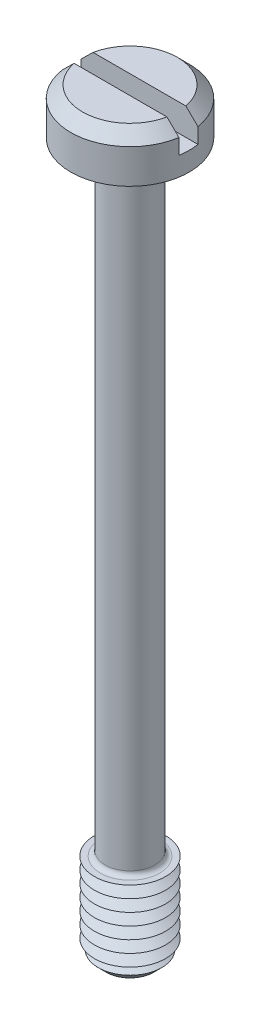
ISO-10303-21;
HEADER;
FILE_DESCRIPTION(('STEP AP214'),'2;1');
FILE_NAME('part.step','',(''),(''),'','','');
FILE_SCHEMA(('AUTOMOTIVE_DESIGN { 1 0 10303 214 1 1 1 1 }'));
ENDSEC;
DATA;
#1=APPLICATION_CONTEXT('core data for automotive mechanical design processes');
#2=APPLICATION_PROTOCOL_DEFINITION('international standard','automotive_design',2000,#1);
#3=PRODUCT_CONTEXT('',#1,'mechanical');
#4=PRODUCT('Part','Part','',(#3));
#5=PRODUCT_RELATED_PRODUCT_CATEGORY('part','',(#4));
#6=PRODUCT_DEFINITION_FORMATION('','',#4);
#7=PRODUCT_DEFINITION_CONTEXT('part definition',#1,'design');
#8=PRODUCT_DEFINITION('design','',#6,#7);
#9=PRODUCT_DEFINITION_SHAPE('','',#8);
#10=(LENGTH_UNIT() NAMED_UNIT(*) SI_UNIT(.MILLI.,.METRE.));
#11=(NAMED_UNIT(*) PLANE_ANGLE_UNIT() SI_UNIT($,.RADIAN.));
#12=(NAMED_UNIT(*) SI_UNIT($,.STERADIAN.) SOLID_ANGLE_UNIT());
#13=UNCERTAINTY_MEASURE_WITH_UNIT(LENGTH_MEASURE(1.E-05),#10,'distance_accuracy_value','');
#14=(GEOMETRIC_REPRESENTATION_CONTEXT(3) GLOBAL_UNCERTAINTY_ASSIGNED_CONTEXT((#13)) GLOBAL_UNIT_ASSIGNED_CONTEXT((#10,
#11,#12)) REPRESENTATION_CONTEXT('',''));
#15=CARTESIAN_POINT('',(0.,0.,0.));
#16=DIRECTION('',(0.,0.,1.));
#17=DIRECTION('',(1.,0.,0.));
#18=AXIS2_PLACEMENT_3D('',#15,#16,#17);
#19=CARTESIAN_POINT('',(0.,3.9,0.));
#20=DIRECTION('',(0.,1.,0.));
#21=DIRECTION('',(0.,0.,1.));
#22=AXIS2_PLACEMENT_3D('',#19,#20,#21);
#23=PLANE('',#22);
#24=DIRECTION('',(-1.,0.,0.));
#25=VECTOR('',#24,1.);
#26=CARTESIAN_POINT('',(5.,3.9,-0.8));
#27=LINE('',#26,#25);
#28=CARTESIAN_POINT('',(3.91918358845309,3.9,-0.8));
#29=VERTEX_POINT('',#28);
#30=CARTESIAN_POINT('',(-3.91918358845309,3.9,-0.8));
#31=VERTEX_POINT('',#30);
#32=EDGE_CURVE('E110',#29,#31,#27,.T.);
#33=ORIENTED_EDGE('',*,*,#32,.F.);
#34=CARTESIAN_POINT('',(0.,3.9,0.));
#35=DIRECTION('',(0.,1.,0.));
#36=DIRECTION('',(0.,0.,1.));
#37=AXIS2_PLACEMENT_3D('',#34,#35,#36);
#38=CIRCLE('',#37,4.);
#39=EDGE_CURVE('E113',#29,#31,#38,.T.);
#40=ORIENTED_EDGE('',*,*,#39,.T.);
#41=EDGE_LOOP('',(#33,#40));
#42=FACE_BOUND('',#41,.T.);
#43=ADVANCED_FACE('F39',(#42),#23,.T.);
#44=CARTESIAN_POINT('',(0.,3.9,0.));
#45=DIRECTION('',(0.,-1.,0.));
#46=DIRECTION('',(0.,0.,-1.));
#47=AXIS2_PLACEMENT_3D('',#44,#45,#46);
#48=CONICAL_SURFACE('',#47,4.,0.785398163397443);
#49=CARTESIAN_POINT('',(11.0010756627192,-3.13012537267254,-0.8));
#50=CARTESIAN_POINT('',(10.6180645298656,-2.74813121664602,-0.8));
#51=CARTESIAN_POINT('',(10.2350087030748,-2.36618183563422,-0.8));
#52=CARTESIAN_POINT('',(9.46873746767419,-1.60241986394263,-0.8));
#53=CARTESIAN_POINT('',(9.08552205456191,-1.22060727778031,-0.8));
#54=CARTESIAN_POINT('',(8.31861292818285,-0.456918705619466,-0.8));
#55=CARTESIAN_POINT('',(7.93491906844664,-0.0750428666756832,-0.8));
#56=CARTESIAN_POINT('',(7.16722555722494,0.68837857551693,-0.8));
#57=CARTESIAN_POINT('',(6.78322591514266,1.06992418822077,-0.8));
#58=CARTESIAN_POINT('',(6.01856215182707,1.82868912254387,-0.8));
#59=CARTESIAN_POINT('',(5.63790309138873,2.20591354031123,-0.8));
#60=CARTESIAN_POINT('',(5.06622054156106,2.7710831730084,-0.8));
#61=CARTESIAN_POINT('',(4.87553531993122,2.9593704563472,-0.8));
#62=CARTESIAN_POINT('',(4.49384424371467,3.33561647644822,-0.8));
#63=CARTESIAN_POINT('',(4.30283839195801,3.52357521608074,-0.8));
#64=CARTESIAN_POINT('',(3.92044271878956,3.89893397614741,-0.8));
#65=CARTESIAN_POINT('',(3.72905310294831,4.08633420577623,-0.8));
#66=CARTESIAN_POINT('',(3.34554223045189,4.46039762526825,-0.8));
#67=CARTESIAN_POINT('',(3.15342094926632,4.64706078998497,-0.8));
#68=CARTESIAN_POINT('',(2.76802565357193,5.01913697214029,-0.8));
#69=CARTESIAN_POINT('',(2.5747518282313,5.20455018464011,-0.8));
#70=CARTESIAN_POINT('',(2.28318236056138,5.4809110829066,-0.8));
#71=CARTESIAN_POINT('',(2.18571873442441,5.57273577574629,-0.8));
#72=CARTESIAN_POINT('',(1.9899843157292,5.75552004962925,-0.8));
#73=CARTESIAN_POINT('',(1.89171354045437,5.84647964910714,-0.8));
#74=CARTESIAN_POINT('',(1.76578543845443,5.96147491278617,-0.8));
#75=CARTESIAN_POINT('',(1.73869031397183,5.98612635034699,-0.8));
#76=CARTESIAN_POINT('',(1.68439529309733,6.03531372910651,-0.8));
#77=CARTESIAN_POINT('',(1.65719539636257,6.05984966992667,-0.8));
#78=CARTESIAN_POINT('',(1.57541627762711,6.13326356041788,-0.8));
#79=CARTESIAN_POINT('',(1.52066027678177,6.18194515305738,-0.8));
#80=CARTESIAN_POINT('',(1.41038257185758,6.27874171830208,-0.8));
#81=CARTESIAN_POINT('',(1.35485918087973,6.32685477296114,-0.8));
#82=CARTESIAN_POINT('',(1.24299231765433,6.42210730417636,-0.8));
#83=CARTESIAN_POINT('',(1.18664895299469,6.46924690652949,-0.8));
#84=CARTESIAN_POINT('',(1.07845249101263,6.55754663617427,-0.8));
#85=CARTESIAN_POINT('',(1.02670624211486,6.5988371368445,-0.8));
#86=CARTESIAN_POINT('',(0.921961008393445,6.67979338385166,-0.8));
#87=CARTESIAN_POINT('',(0.868962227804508,6.71945939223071,-0.8));
#88=CARTESIAN_POINT('',(0.761295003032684,6.79630361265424,-0.8));
#89=CARTESIAN_POINT('',(0.706629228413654,6.8334855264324,-0.8));
#90=CARTESIAN_POINT('',(0.594896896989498,6.90399895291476,-0.8));
#91=CARTESIAN_POINT('',(0.537833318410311,6.93733506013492,-0.8));
#92=CARTESIAN_POINT('',(0.428390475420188,6.9935634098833,-0.8));
#93=CARTESIAN_POINT('',(0.376435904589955,7.01726022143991,-0.8));
#94=CARTESIAN_POINT('',(0.269759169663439,7.05717670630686,-0.8));
#95=CARTESIAN_POINT('',(0.215046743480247,7.07342088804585,-0.8));
#96=CARTESIAN_POINT('',(0.113016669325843,7.09332110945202,-0.8));
#97=CARTESIAN_POINT('',(0.0660435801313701,7.098660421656,-0.8));
#98=CARTESIAN_POINT('',(-0.0280587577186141,7.10088875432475,-0.8));
#99=CARTESIAN_POINT('',(-0.0751877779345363,7.09778705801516,-0.8));
#100=CARTESIAN_POINT('',(-0.180723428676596,7.08192474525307,-0.8));
#101=CARTESIAN_POINT('',(-0.238762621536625,7.06679554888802,-0.8));
#102=CARTESIAN_POINT('',(-0.323499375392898,7.0374840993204,-0.8));
#103=CARTESIAN_POINT('',(-0.351441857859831,7.02656594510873,-0.8));
#104=CARTESIAN_POINT('',(-0.406569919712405,7.0029590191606,-0.8));
#105=CARTESIAN_POINT('',(-0.433755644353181,6.99027059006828,-0.8));
#106=CARTESIAN_POINT('',(-0.504673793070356,6.95489235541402,-0.8));
#107=CARTESIAN_POINT('',(-0.547808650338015,6.93101671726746,-0.8));
#108=CARTESIAN_POINT('',(-0.632566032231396,6.8806964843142,-0.8));
#109=CARTESIAN_POINT('',(-0.674187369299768,6.8542499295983,-0.8));
#110=CARTESIAN_POINT('',(-0.756326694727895,6.79950439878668,-0.8));
#111=CARTESIAN_POINT('',(-0.796841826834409,6.77120117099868,-0.8));
#112=CARTESIAN_POINT('',(-0.876938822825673,6.7132985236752,-0.8));
#113=CARTESIAN_POINT('',(-0.916520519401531,6.68369887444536,-0.8));
#114=CARTESIAN_POINT('',(-1.03465904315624,6.59312324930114,-0.8));
#115=CARTESIAN_POINT('',(-1.1121133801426,6.53071425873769,-0.8));
#116=CARTESIAN_POINT('',(-1.26505454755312,6.40381418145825,-0.8));
#117=CARTESIAN_POINT('',(-1.34054439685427,6.33932667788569,-0.8));
#118=CARTESIAN_POINT('',(-1.48913173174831,6.20997083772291,-0.8));
#119=CARTESIAN_POINT('',(-1.56224816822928,6.14512422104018,-0.8));
#120=CARTESIAN_POINT('',(-1.70765393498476,6.01451044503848,-0.8));
#121=CARTESIAN_POINT('',(-1.7799432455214,5.9487432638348,-0.8));
#122=CARTESIAN_POINT('',(-1.99594639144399,5.75046596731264,-0.8));
#123=CARTESIAN_POINT('',(-2.13877767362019,5.6169958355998,-0.8));
#124=CARTESIAN_POINT('',(-2.42324632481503,5.34853800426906,-0.8));
#125=CARTESIAN_POINT('',(-2.56488247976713,5.21354902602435,-0.8));
#126=CARTESIAN_POINT('',(-2.84730929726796,4.94270932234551,-0.8));
#127=CARTESIAN_POINT('',(-2.98810001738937,4.80685865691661,-0.8));
#128=CARTESIAN_POINT('',(-3.26818763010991,4.5354997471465,-0.8));
#129=CARTESIAN_POINT('',(-3.4074882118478,4.39999530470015,-0.8));
#130=CARTESIAN_POINT('',(-3.68570899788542,4.12859172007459,-0.8));
#131=CARTESIAN_POINT('',(-3.82462919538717,3.99269257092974,-0.8));
#132=CARTESIAN_POINT('',(-4.2408754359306,3.58468153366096,-0.8));
#133=CARTESIAN_POINT('',(-4.51779300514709,3.31215310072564,-0.8));
#134=CARTESIAN_POINT('',(-5.05279381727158,2.78443938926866,-0.8));
#135=CARTESIAN_POINT('',(-5.3109163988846,2.52929393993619,-0.8));
#136=CARTESIAN_POINT('',(-5.82680751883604,2.01864429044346,-0.8));
#137=CARTESIAN_POINT('',(-6.08457605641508,1.76314008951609,-0.8));
#138=CARTESIAN_POINT('',(-6.8576050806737,0.996194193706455,-0.8));
#139=CARTESIAN_POINT('',(-7.37251152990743,0.484395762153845,-0.8));
#140=CARTESIAN_POINT('',(-8.40657233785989,-0.544392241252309,-0.8));
#141=CARTESIAN_POINT('',(-8.92572224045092,-1.06138628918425,-0.8));
#142=CARTESIAN_POINT('',(-9.9636287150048,-2.09560660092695,-0.8));
#143=CARTESIAN_POINT('',(-10.4823853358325,-2.61283281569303,-0.8));
#144=CARTESIAN_POINT('',(-11.0010756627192,-3.13012537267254,-0.8));
#145=B_SPLINE_CURVE_WITH_KNOTS('',3,(#49,#50,#51,#52,#53,#54,#55,#56,#57,#58,#59,#60,#61,#62,
#63,#64,#65,#66,#67,#68,#69,#70,#71,#72,#73,#74,#75,#76,#77,#78,#79,#80,#81,#82,#83,#84,#85,#86,
#87,#88,#89,#90,#91,#92,#93,#94,#95,#96,#97,#98,#99,#100,#101,#102,#103,#104,#105,#106,#107,
#108,#109,#110,#111,#112,#113,#114,#115,#116,#117,#118,#119,#120,#121,#122,#123,#124,#125,#126,
#127,#128,#129,#130,#131,#132,#133,#134,#135,#136,#137,#138,#139,#140,#141,#142,#143,#144),
.UNSPECIFIED.,.F.,.F.,(4,2,2,2,2,2,2,2,2,2,2,2,2,2,2,2,2,2,2,2,2,2,2,2,2,2,2,2,2,2,2,2,2,2,2,2,
2,2,2,2,2,2,2,2,2,2,2,4),(0.,1.62282275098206,3.24569489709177,4.86971791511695,
6.49369278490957,8.10142191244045,8.90535980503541,9.70929063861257,10.5128682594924,
11.3164730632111,12.1199494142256,12.5216659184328,12.9233738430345,13.0332669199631,
13.1431603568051,13.3629580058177,13.5833578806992,13.8037290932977,14.0023112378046,
14.2008612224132,14.3991084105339,14.5971162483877,14.7680800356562,14.9384774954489,
15.0795987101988,15.2205647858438,15.399358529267,15.4893211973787,15.579266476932,
15.7270328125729,15.8749126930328,16.0231439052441,16.1714014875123,16.4697244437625,
16.7675580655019,17.0607348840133,17.3539186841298,17.9403574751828,18.527333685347,
19.1142694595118,19.6972736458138,20.2802881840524,21.4458742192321,22.5346981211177,
23.6235243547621,25.8015035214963,27.9995014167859,30.1971550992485),.UNSPECIFIED.);
#146=CARTESIAN_POINT('',(4.93558507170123,2.89999999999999,-0.8));
#147=VERTEX_POINT('',#146);
#148=EDGE_CURVE('E252',#147,#29,#145,.T.);
#149=ORIENTED_EDGE('',*,*,#148,.F.);
#150=CARTESIAN_POINT('',(0.,2.89999999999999,0.));
#151=DIRECTION('',(0.,1.,0.));
#152=DIRECTION('',(0.,0.,1.));
#153=AXIS2_PLACEMENT_3D('',#150,#151,#152);
#154=CIRCLE('',#153,5.);
#155=CARTESIAN_POINT('',(-4.93558507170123,2.89999999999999,-0.8));
#156=VERTEX_POINT('',#155);
#157=EDGE_CURVE('E128',#156,#147,#154,.F.);
#158=ORIENTED_EDGE('',*,*,#157,.F.);
#159=EDGE_CURVE('E102',#31,#156,#145,.T.);
#160=ORIENTED_EDGE('',*,*,#159,.F.);
#161=ORIENTED_EDGE('',*,*,#39,.F.);
#162=EDGE_LOOP('',(#149,#158,#160,#161));
#163=FACE_BOUND('',#162,.T.);
#164=ADVANCED_FACE('F214',(#163),#48,.T.);
#165=CARTESIAN_POINT('',(0.,-60.,0.));
#166=DIRECTION('',(0.,1.,0.));
#167=DIRECTION('',(0.,0.,1.));
#168=AXIS2_PLACEMENT_3D('',#165,#166,#167);
#169=CYLINDRICAL_SURFACE('',#168,2.1);
#170=CARTESIAN_POINT('',(0.,-52.1,0.));
#171=DIRECTION('',(0.,-1.,0.));
#172=DIRECTION('',(0.,0.,-1.));
#173=AXIS2_PLACEMENT_3D('',#170,#171,#172);
#174=CIRCLE('',#173,2.1);
#175=CARTESIAN_POINT('',(0.,-52.1,-2.1));
#176=VERTEX_POINT('',#175);
#177=EDGE_CURVE('E123',#176,#176,#174,.F.);
#178=ORIENTED_EDGE('',*,*,#177,.T.);
#179=EDGE_LOOP('',(#178));
#180=FACE_BOUND('',#179,.T.);
#181=CARTESIAN_POINT('',(0.,-0.399999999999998,0.));
#182=DIRECTION('',(0.,1.,0.));
#183=DIRECTION('',(0.,0.,1.));
#184=AXIS2_PLACEMENT_3D('',#181,#182,#183);
#185=CIRCLE('',#184,2.1);
#186=CARTESIAN_POINT('',(0.,-0.399999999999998,2.1));
#187=VERTEX_POINT('',#186);
#188=EDGE_CURVE('E349',#187,#187,#185,.F.);
#189=ORIENTED_EDGE('',*,*,#188,.T.);
#190=EDGE_LOOP('',(#189));
#191=FACE_BOUND('',#190,.T.);
#192=ADVANCED_FACE('F210',(#180,#191),#169,.T.);
#193=CARTESIAN_POINT('',(0.,3.9,0.));
#194=DIRECTION('',(0.,-1.,0.));
#195=DIRECTION('',(0.,0.,-1.));
#196=AXIS2_PLACEMENT_3D('',#193,#194,#195);
#197=CYLINDRICAL_SURFACE('',#196,5.);
#198=ORIENTED_EDGE('',*,*,#157,.T.);
#199=DIRECTION('',(0.,-1.,0.));
#200=VECTOR('',#199,1.);
#201=CARTESIAN_POINT('',(4.93558507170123,3.9,-0.8));
#202=LINE('',#201,#200);
#203=CARTESIAN_POINT('',(4.93558507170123,1.6,-0.8));
#204=VERTEX_POINT('',#203);
#205=EDGE_CURVE('E64',#147,#204,#202,.T.);
#206=ORIENTED_EDGE('',*,*,#205,.T.);
#207=CARTESIAN_POINT('',(0.,1.6,0.));
#208=DIRECTION('',(0.,1.,0.));
#209=DIRECTION('',(0.,0.,1.));
#210=AXIS2_PLACEMENT_3D('',#207,#208,#209);
#211=CIRCLE('',#210,5.);
#212=CARTESIAN_POINT('',(4.93558507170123,1.6,0.8));
#213=VERTEX_POINT('',#212);
#214=EDGE_CURVE('E11',#213,#204,#211,.T.);
#215=ORIENTED_EDGE('',*,*,#214,.F.);
#216=DIRECTION('',(0.,-1.,0.));
#217=VECTOR('',#216,1.);
#218=CARTESIAN_POINT('',(4.93558507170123,3.9,0.8));
#219=LINE('',#218,#217);
#220=CARTESIAN_POINT('',(4.93558507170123,2.89999999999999,0.8));
#221=VERTEX_POINT('',#220);
#222=EDGE_CURVE('E269',#213,#221,#219,.F.);
#223=ORIENTED_EDGE('',*,*,#222,.T.);
#224=CARTESIAN_POINT('',(-4.93558507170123,2.89999999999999,0.8));
#225=VERTEX_POINT('',#224);
#226=EDGE_CURVE('E120',#221,#225,#154,.F.);
#227=ORIENTED_EDGE('',*,*,#226,.T.);
#228=DIRECTION('',(0.,-1.,0.));
#229=VECTOR('',#228,1.);
#230=CARTESIAN_POINT('',(-4.93558507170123,3.9,0.8));
#231=LINE('',#230,#229);
#232=CARTESIAN_POINT('',(-4.93558507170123,1.6,0.8));
#233=VERTEX_POINT('',#232);
#234=EDGE_CURVE('E96',#225,#233,#231,.T.);
#235=ORIENTED_EDGE('',*,*,#234,.T.);
#236=CARTESIAN_POINT('',(-4.93558507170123,1.6,-0.8));
#237=VERTEX_POINT('',#236);
#238=EDGE_CURVE('E44',#237,#233,#211,.T.);
#239=ORIENTED_EDGE('',*,*,#238,.F.);
#240=DIRECTION('',(0.,-1.,0.));
#241=VECTOR('',#240,1.);
#242=CARTESIAN_POINT('',(-4.93558507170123,3.9,-0.8));
#243=LINE('',#242,#241);
#244=EDGE_CURVE('E274',#237,#156,#243,.F.);
#245=ORIENTED_EDGE('',*,*,#244,.T.);
#246=EDGE_LOOP('',(#198,#206,#215,#223,#227,#235,#239,#245));
#247=FACE_BOUND('',#246,.T.);
#248=CARTESIAN_POINT('',(0.,0.,0.));
#249=DIRECTION('',(0.,1.,0.));
#250=DIRECTION('',(0.,0.,1.));
#251=AXIS2_PLACEMENT_3D('',#248,#249,#250);
#252=CIRCLE('',#251,5.);
#253=CARTESIAN_POINT('',(0.,0.,5.));
#254=VERTEX_POINT('',#253);
#255=EDGE_CURVE('E334',#254,#254,#252,.T.);
#256=ORIENTED_EDGE('',*,*,#255,.T.);
#257=EDGE_LOOP('',(#256));
#258=FACE_BOUND('',#257,.T.);
#259=ADVANCED_FACE('F213',(#247,#258),#197,.T.);
#260=DIRECTION('',(1.,0.,0.));
#261=VECTOR('',#260,1.);
#262=CARTESIAN_POINT('',(5.,3.9,0.8));
#263=LINE('',#262,#261);
#264=CARTESIAN_POINT('',(-3.91918358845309,3.9,0.8));
#265=VERTEX_POINT('',#264);
#266=CARTESIAN_POINT('',(3.91918358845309,3.9,0.8));
#267=VERTEX_POINT('',#266);
#268=EDGE_CURVE('E56',#265,#267,#263,.T.);
#269=ORIENTED_EDGE('',*,*,#268,.F.);
#270=EDGE_CURVE('E108',#265,#267,#38,.T.);
#271=ORIENTED_EDGE('',*,*,#270,.T.);
#272=EDGE_LOOP('',(#269,#271));
#273=FACE_BOUND('',#272,.T.);
#274=ADVANCED_FACE('F107',(#273),#23,.T.);
#275=CARTESIAN_POINT('',(0.,0.,0.));
#276=DIRECTION('',(0.,1.,0.));
#277=DIRECTION('',(0.,0.,1.));
#278=AXIS2_PLACEMENT_3D('',#275,#276,#277);
#279=PLANE('',#278);
#280=CARTESIAN_POINT('',(0.,0.,0.));
#281=DIRECTION('',(0.,1.,0.));
#282=DIRECTION('',(0.,0.,1.));
#283=AXIS2_PLACEMENT_3D('',#280,#281,#282);
#284=CIRCLE('',#283,2.5);
#285=CARTESIAN_POINT('',(0.,0.,2.5));
#286=VERTEX_POINT('',#285);
#287=EDGE_CURVE('E114',#286,#286,#284,.T.);
#288=ORIENTED_EDGE('',*,*,#287,.T.);
#289=EDGE_LOOP('',(#288));
#290=FACE_BOUND('',#289,.T.);
#291=ORIENTED_EDGE('',*,*,#255,.F.);
#292=EDGE_LOOP('',(#291));
#293=FACE_BOUND('',#292,.T.);
#294=ADVANCED_FACE('F204',(#290,#293),#279,.F.);
#295=CARTESIAN_POINT('',(0.,-52.5,0.));
#296=DIRECTION('',(0.,-1.,0.));
#297=DIRECTION('',(0.,0.,-1.));
#298=AXIS2_PLACEMENT_3D('',#295,#296,#297);
#299=PLANE('',#298);
#300=CARTESIAN_POINT('',(0.,-52.5,0.));
#301=DIRECTION('',(0.,-1.,0.));
#302=DIRECTION('',(0.,0.,-1.));
#303=AXIS2_PLACEMENT_3D('',#300,#301,#302);
#304=CIRCLE('',#303,2.5);
#305=CARTESIAN_POINT('',(0.,-52.5,-2.5));
#306=VERTEX_POINT('',#305);
#307=EDGE_CURVE('E342',#306,#306,#304,.T.);
#308=ORIENTED_EDGE('',*,*,#307,.T.);
#309=EDGE_LOOP('',(#308));
#310=FACE_BOUND('',#309,.T.);
#311=CARTESIAN_POINT('',(0.,-52.5,0.));
#312=DIRECTION('',(0.,1.,0.));
#313=DIRECTION('',(0.,0.,1.));
#314=AXIS2_PLACEMENT_3D('',#311,#312,#313);
#315=CIRCLE('',#314,3.);
#316=CARTESIAN_POINT('',(0.,-52.5,3.));
#317=VERTEX_POINT('',#316);
#318=EDGE_CURVE('E330',#317,#317,#315,.T.);
#319=ORIENTED_EDGE('',*,*,#318,.T.);
#320=EDGE_LOOP('',(#319));
#321=FACE_BOUND('',#320,.T.);
#322=ADVANCED_FACE('F200',(#310,#321),#299,.F.);
#323=CARTESIAN_POINT('',(0.,-53.,0.));
#324=DIRECTION('',(0.,1.,0.));
#325=DIRECTION('',(0.,0.,1.));
#326=AXIS2_PLACEMENT_3D('',#323,#324,#325);
#327=CONICAL_SURFACE('',#326,2.13397459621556,1.0471975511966);
#328=ORIENTED_EDGE('',*,*,#318,.F.);
#329=EDGE_LOOP('',(#328));
#330=FACE_BOUND('',#329,.T.);
#331=CARTESIAN_POINT('',(0.,-53.,0.));
#332=DIRECTION('',(0.,1.,0.));
#333=DIRECTION('',(0.,0.,1.));
#334=AXIS2_PLACEMENT_3D('',#331,#332,#333);
#335=CIRCLE('',#334,2.13397459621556);
#336=CARTESIAN_POINT('',(0.,-53.,2.13397459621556));
#337=VERTEX_POINT('',#336);
#338=EDGE_CURVE('E326',#337,#337,#335,.T.);
#339=ORIENTED_EDGE('',*,*,#338,.T.);
#340=EDGE_LOOP('',(#339));
#341=FACE_BOUND('',#340,.T.);
#342=ADVANCED_FACE('F196',(#330,#341),#327,.T.);
#343=CARTESIAN_POINT('',(0.,-53.5,0.));
#344=DIRECTION('',(0.,-1.,0.));
#345=DIRECTION('',(0.,0.,-1.));
#346=AXIS2_PLACEMENT_3D('',#343,#344,#345);
#347=CONICAL_SURFACE('',#346,3.,1.0471975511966);
#348=ORIENTED_EDGE('',*,*,#338,.F.);
#349=EDGE_LOOP('',(#348));
#350=FACE_BOUND('',#349,.T.);
#351=CARTESIAN_POINT('',(0.,-53.5,0.));
#352=DIRECTION('',(0.,1.,0.));
#353=DIRECTION('',(0.,0.,1.));
#354=AXIS2_PLACEMENT_3D('',#351,#352,#353);
#355=CIRCLE('',#354,3.);
#356=CARTESIAN_POINT('',(0.,-53.5,3.));
#357=VERTEX_POINT('',#356);
#358=EDGE_CURVE('E323',#357,#357,#355,.T.);
#359=ORIENTED_EDGE('',*,*,#358,.T.);
#360=EDGE_LOOP('',(#359));
#361=FACE_BOUND('',#360,.T.);
#362=ADVANCED_FACE('F192',(#350,#361),#347,.T.);
#363=CARTESIAN_POINT('',(0.,-54.,0.));
#364=DIRECTION('',(0.,1.,0.));
#365=DIRECTION('',(0.,0.,1.));
#366=AXIS2_PLACEMENT_3D('',#363,#364,#365);
#367=CONICAL_SURFACE('',#366,2.13397459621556,1.0471975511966);
#368=ORIENTED_EDGE('',*,*,#358,.F.);
#369=EDGE_LOOP('',(#368));
#370=FACE_BOUND('',#369,.T.);
#371=CARTESIAN_POINT('',(0.,-54.,0.));
#372=DIRECTION('',(0.,1.,0.));
#373=DIRECTION('',(0.,0.,1.));
#374=AXIS2_PLACEMENT_3D('',#371,#372,#373);
#375=CIRCLE('',#374,2.13397459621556);
#376=CARTESIAN_POINT('',(0.,-54.,2.13397459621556));
#377=VERTEX_POINT('',#376);
#378=EDGE_CURVE('E319',#377,#377,#375,.T.);
#379=ORIENTED_EDGE('',*,*,#378,.T.);
#380=EDGE_LOOP('',(#379));
#381=FACE_BOUND('',#380,.T.);
#382=ADVANCED_FACE('F188',(#370,#381),#367,.T.);
#383=CARTESIAN_POINT('',(0.,-54.5,0.));
#384=DIRECTION('',(0.,-1.,0.));
#385=DIRECTION('',(0.,0.,-1.));
#386=AXIS2_PLACEMENT_3D('',#383,#384,#385);
#387=CONICAL_SURFACE('',#386,3.,1.0471975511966);
#388=ORIENTED_EDGE('',*,*,#378,.F.);
#389=EDGE_LOOP('',(#388));
#390=FACE_BOUND('',#389,.T.);
#391=CARTESIAN_POINT('',(0.,-54.5,0.));
#392=DIRECTION('',(0.,1.,0.));
#393=DIRECTION('',(0.,0.,1.));
#394=AXIS2_PLACEMENT_3D('',#391,#392,#393);
#395=CIRCLE('',#394,3.);
#396=CARTESIAN_POINT('',(0.,-54.5,3.));
#397=VERTEX_POINT('',#396);
#398=EDGE_CURVE('E316',#397,#397,#395,.T.);
#399=ORIENTED_EDGE('',*,*,#398,.T.);
#400=EDGE_LOOP('',(#399));
#401=FACE_BOUND('',#400,.T.);
#402=ADVANCED_FACE('F184',(#390,#401),#387,.T.);
#403=CARTESIAN_POINT('',(0.,-55.,0.));
#404=DIRECTION('',(0.,1.,0.));
#405=DIRECTION('',(0.,0.,1.));
#406=AXIS2_PLACEMENT_3D('',#403,#404,#405);
#407=CONICAL_SURFACE('',#406,2.13397459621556,1.0471975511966);
#408=ORIENTED_EDGE('',*,*,#398,.F.);
#409=EDGE_LOOP('',(#408));
#410=FACE_BOUND('',#409,.T.);
#411=CARTESIAN_POINT('',(0.,-55.,0.));
#412=DIRECTION('',(0.,1.,0.));
#413=DIRECTION('',(0.,0.,1.));
#414=AXIS2_PLACEMENT_3D('',#411,#412,#413);
#415=CIRCLE('',#414,2.13397459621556);
#416=CARTESIAN_POINT('',(0.,-55.,2.13397459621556));
#417=VERTEX_POINT('',#416);
#418=EDGE_CURVE('E312',#417,#417,#415,.T.);
#419=ORIENTED_EDGE('',*,*,#418,.T.);
#420=EDGE_LOOP('',(#419));
#421=FACE_BOUND('',#420,.T.);
#422=ADVANCED_FACE('F180',(#410,#421),#407,.T.);
#423=CARTESIAN_POINT('',(0.,-55.5,0.));
#424=DIRECTION('',(0.,-1.,0.));
#425=DIRECTION('',(0.,0.,-1.));
#426=AXIS2_PLACEMENT_3D('',#423,#424,#425);
#427=CONICAL_SURFACE('',#426,3.,1.0471975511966);
#428=ORIENTED_EDGE('',*,*,#418,.F.);
#429=EDGE_LOOP('',(#428));
#430=FACE_BOUND('',#429,.T.);
#431=CARTESIAN_POINT('',(0.,-55.5,0.));
#432=DIRECTION('',(0.,1.,0.));
#433=DIRECTION('',(0.,0.,1.));
#434=AXIS2_PLACEMENT_3D('',#431,#432,#433);
#435=CIRCLE('',#434,3.);
#436=CARTESIAN_POINT('',(0.,-55.5,3.));
#437=VERTEX_POINT('',#436);
#438=EDGE_CURVE('E308',#437,#437,#435,.T.);
#439=ORIENTED_EDGE('',*,*,#438,.T.);
#440=EDGE_LOOP('',(#439));
#441=FACE_BOUND('',#440,.T.);
#442=ADVANCED_FACE('F176',(#430,#441),#427,.T.);
#443=CARTESIAN_POINT('',(0.,-56.,0.));
#444=DIRECTION('',(0.,1.,0.));
#445=DIRECTION('',(0.,0.,1.));
#446=AXIS2_PLACEMENT_3D('',#443,#444,#445);
#447=CONICAL_SURFACE('',#446,2.13397459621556,1.0471975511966);
#448=ORIENTED_EDGE('',*,*,#438,.F.);
#449=EDGE_LOOP('',(#448));
#450=FACE_BOUND('',#449,.T.);
#451=CARTESIAN_POINT('',(0.,-56.,0.));
#452=DIRECTION('',(0.,1.,0.));
#453=DIRECTION('',(0.,0.,1.));
#454=AXIS2_PLACEMENT_3D('',#451,#452,#453);
#455=CIRCLE('',#454,2.13397459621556);
#456=CARTESIAN_POINT('',(0.,-56.,2.13397459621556));
#457=VERTEX_POINT('',#456);
#458=EDGE_CURVE('E305',#457,#457,#455,.T.);
#459=ORIENTED_EDGE('',*,*,#458,.T.);
#460=EDGE_LOOP('',(#459));
#461=FACE_BOUND('',#460,.T.);
#462=ADVANCED_FACE('F172',(#450,#461),#447,.T.);
#463=CARTESIAN_POINT('',(0.,-56.5,0.));
#464=DIRECTION('',(0.,-1.,0.));
#465=DIRECTION('',(0.,0.,-1.));
#466=AXIS2_PLACEMENT_3D('',#463,#464,#465);
#467=CONICAL_SURFACE('',#466,3.,1.0471975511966);
#468=ORIENTED_EDGE('',*,*,#458,.F.);
#469=EDGE_LOOP('',(#468));
#470=FACE_BOUND('',#469,.T.);
#471=CARTESIAN_POINT('',(0.,-56.5,0.));
#472=DIRECTION('',(0.,1.,0.));
#473=DIRECTION('',(0.,0.,1.));
#474=AXIS2_PLACEMENT_3D('',#471,#472,#473);
#475=CIRCLE('',#474,3.);
#476=CARTESIAN_POINT('',(0.,-56.5,3.));
#477=VERTEX_POINT('',#476);
#478=EDGE_CURVE('E301',#477,#477,#475,.T.);
#479=ORIENTED_EDGE('',*,*,#478,.T.);
#480=EDGE_LOOP('',(#479));
#481=FACE_BOUND('',#480,.T.);
#482=ADVANCED_FACE('F168',(#470,#481),#467,.T.);
#483=CARTESIAN_POINT('',(0.,-57.,0.));
#484=DIRECTION('',(0.,1.,0.));
#485=DIRECTION('',(0.,0.,1.));
#486=AXIS2_PLACEMENT_3D('',#483,#484,#485);
#487=CONICAL_SURFACE('',#486,2.13397459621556,1.0471975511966);
#488=ORIENTED_EDGE('',*,*,#478,.F.);
#489=EDGE_LOOP('',(#488));
#490=FACE_BOUND('',#489,.T.);
#491=CARTESIAN_POINT('',(0.,-57.,0.));
#492=DIRECTION('',(0.,1.,0.));
#493=DIRECTION('',(0.,0.,1.));
#494=AXIS2_PLACEMENT_3D('',#491,#492,#493);
#495=CIRCLE('',#494,2.13397459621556);
#496=CARTESIAN_POINT('',(0.,-57.,2.13397459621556));
#497=VERTEX_POINT('',#496);
#498=EDGE_CURVE('E298',#497,#497,#495,.T.);
#499=ORIENTED_EDGE('',*,*,#498,.T.);
#500=EDGE_LOOP('',(#499));
#501=FACE_BOUND('',#500,.T.);
#502=ADVANCED_FACE('F164',(#490,#501),#487,.T.);
#503=CARTESIAN_POINT('',(0.,-57.5,0.));
#504=DIRECTION('',(0.,-1.,0.));
#505=DIRECTION('',(0.,0.,-1.));
#506=AXIS2_PLACEMENT_3D('',#503,#504,#505);
#507=CONICAL_SURFACE('',#506,3.,1.0471975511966);
#508=ORIENTED_EDGE('',*,*,#498,.F.);
#509=EDGE_LOOP('',(#508));
#510=FACE_BOUND('',#509,.T.);
#511=CARTESIAN_POINT('',(0.,-57.5,0.));
#512=DIRECTION('',(0.,1.,0.));
#513=DIRECTION('',(0.,0.,1.));
#514=AXIS2_PLACEMENT_3D('',#511,#512,#513);
#515=CIRCLE('',#514,3.);
#516=CARTESIAN_POINT('',(0.,-57.5,3.));
#517=VERTEX_POINT('',#516);
#518=EDGE_CURVE('E295',#517,#517,#515,.T.);
#519=ORIENTED_EDGE('',*,*,#518,.T.);
#520=EDGE_LOOP('',(#519));
#521=FACE_BOUND('',#520,.T.);
#522=ADVANCED_FACE('F160',(#510,#521),#507,.T.);
#523=CARTESIAN_POINT('',(0.,-58.,0.));
#524=DIRECTION('',(0.,1.,0.));
#525=DIRECTION('',(0.,0.,1.));
#526=AXIS2_PLACEMENT_3D('',#523,#524,#525);
#527=CONICAL_SURFACE('',#526,2.13397459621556,1.0471975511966);
#528=ORIENTED_EDGE('',*,*,#518,.F.);
#529=EDGE_LOOP('',(#528));
#530=FACE_BOUND('',#529,.T.);
#531=CARTESIAN_POINT('',(0.,-58.,0.));
#532=DIRECTION('',(0.,1.,0.));
#533=DIRECTION('',(0.,0.,1.));
#534=AXIS2_PLACEMENT_3D('',#531,#532,#533);
#535=CIRCLE('',#534,2.13397459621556);
#536=CARTESIAN_POINT('',(0.,-58.,2.13397459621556));
#537=VERTEX_POINT('',#536);
#538=EDGE_CURVE('E291',#537,#537,#535,.T.);
#539=ORIENTED_EDGE('',*,*,#538,.T.);
#540=EDGE_LOOP('',(#539));
#541=FACE_BOUND('',#540,.T.);
#542=ADVANCED_FACE('F156',(#530,#541),#527,.T.);
#543=CARTESIAN_POINT('',(0.,-58.5,0.));
#544=DIRECTION('',(0.,-1.,0.));
#545=DIRECTION('',(0.,0.,-1.));
#546=AXIS2_PLACEMENT_3D('',#543,#544,#545);
#547=CONICAL_SURFACE('',#546,3.,1.0471975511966);
#548=ORIENTED_EDGE('',*,*,#538,.F.);
#549=EDGE_LOOP('',(#548));
#550=FACE_BOUND('',#549,.T.);
#551=CARTESIAN_POINT('',(0.,-58.5,0.));
#552=DIRECTION('',(0.,1.,0.));
#553=DIRECTION('',(0.,0.,1.));
#554=AXIS2_PLACEMENT_3D('',#551,#552,#553);
#555=CIRCLE('',#554,3.);
#556=CARTESIAN_POINT('',(0.,-58.5,3.));
#557=VERTEX_POINT('',#556);
#558=EDGE_CURVE('E287',#557,#557,#555,.T.);
#559=ORIENTED_EDGE('',*,*,#558,.T.);
#560=EDGE_LOOP('',(#559));
#561=FACE_BOUND('',#560,.T.);
#562=ADVANCED_FACE('F152',(#550,#561),#547,.T.);
#563=CARTESIAN_POINT('',(0.,-59.,0.));
#564=DIRECTION('',(0.,1.,0.));
#565=DIRECTION('',(0.,0.,1.));
#566=AXIS2_PLACEMENT_3D('',#563,#564,#565);
#567=CONICAL_SURFACE('',#566,2.13397459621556,1.0471975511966);
#568=ORIENTED_EDGE('',*,*,#558,.F.);
#569=EDGE_LOOP('',(#568));
#570=FACE_BOUND('',#569,.T.);
#571=CARTESIAN_POINT('',(0.,-59.,0.));
#572=DIRECTION('',(0.,1.,0.));
#573=DIRECTION('',(0.,0.,1.));
#574=AXIS2_PLACEMENT_3D('',#571,#572,#573);
#575=CIRCLE('',#574,2.13397459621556);
#576=CARTESIAN_POINT('',(0.,-59.,2.13397459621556));
#577=VERTEX_POINT('',#576);
#578=EDGE_CURVE('E283',#577,#577,#575,.T.);
#579=ORIENTED_EDGE('',*,*,#578,.T.);
#580=EDGE_LOOP('',(#579));
#581=FACE_BOUND('',#580,.T.);
#582=ADVANCED_FACE('F148',(#570,#581),#567,.T.);
#583=CARTESIAN_POINT('',(0.,-59.5,0.));
#584=DIRECTION('',(0.,-1.,0.));
#585=DIRECTION('',(0.,0.,-1.));
#586=AXIS2_PLACEMENT_3D('',#583,#584,#585);
#587=CONICAL_SURFACE('',#586,3.,1.0471975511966);
#588=CARTESIAN_POINT('',(0.,-59.3169872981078,0.));
#589=DIRECTION('',(0.,-1.,0.));
#590=DIRECTION('',(0.,0.,-1.));
#591=AXIS2_PLACEMENT_3D('',#588,#589,#590);
#592=CIRCLE('',#591,2.68301270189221);
#593=CARTESIAN_POINT('',(0.,-59.3169872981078,-2.68301270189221));
#594=VERTEX_POINT('',#593);
#595=EDGE_CURVE('E290',#594,#594,#592,.F.);
#596=ORIENTED_EDGE('',*,*,#595,.T.);
#597=EDGE_LOOP('',(#596));
#598=FACE_BOUND('',#597,.T.);
#599=ORIENTED_EDGE('',*,*,#578,.F.);
#600=EDGE_LOOP('',(#599));
#601=FACE_BOUND('',#600,.T.);
#602=ADVANCED_FACE('F144',(#598,#601),#587,.T.);
#603=CARTESIAN_POINT('',(0.,-60.,0.));
#604=DIRECTION('',(0.,-1.,0.));
#605=DIRECTION('',(0.,0.,-1.));
#606=AXIS2_PLACEMENT_3D('',#603,#604,#605);
#607=PLANE('',#606);
#608=CARTESIAN_POINT('',(0.,-60.,0.));
#609=DIRECTION('',(0.,-1.,0.));
#610=DIRECTION('',(0.,0.,-1.));
#611=AXIS2_PLACEMENT_3D('',#608,#609,#610);
#612=CIRCLE('',#611,1.99999999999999);
#613=CARTESIAN_POINT('',(0.,-60.,-1.99999999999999));
#614=VERTEX_POINT('',#613);
#615=EDGE_CURVE('E338',#614,#614,#612,.T.);
#616=ORIENTED_EDGE('',*,*,#615,.T.);
#617=EDGE_LOOP('',(#616));
#618=FACE_BOUND('',#617,.T.);
#619=ADVANCED_FACE('F147',(#618),#607,.T.);
#620=CARTESIAN_POINT('',(0.,-60.,0.));
#621=DIRECTION('',(0.,1.,0.));
#622=DIRECTION('',(0.,0.,1.));
#623=AXIS2_PLACEMENT_3D('',#620,#621,#622);
#624=CONICAL_SURFACE('',#623,1.99999999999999,0.785398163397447);
#625=ORIENTED_EDGE('',*,*,#595,.F.);
#626=EDGE_LOOP('',(#625));
#627=FACE_BOUND('',#626,.T.);
#628=ORIENTED_EDGE('',*,*,#615,.F.);
#629=EDGE_LOOP('',(#628));
#630=FACE_BOUND('',#629,.T.);
#631=ADVANCED_FACE('F208',(#627,#630),#624,.T.);
#632=CARTESIAN_POINT('',(0.,-52.1,0.));
#633=DIRECTION('',(0.,-1.,0.));
#634=DIRECTION('',(0.,0.,-1.));
#635=AXIS2_PLACEMENT_3D('',#632,#633,#634);
#636=TOROIDAL_SURFACE('',#635,2.5,0.4);
#637=ORIENTED_EDGE('',*,*,#177,.F.);
#638=EDGE_LOOP('',(#637));
#639=FACE_BOUND('',#638,.T.);
#640=ORIENTED_EDGE('',*,*,#307,.F.);
#641=EDGE_LOOP('',(#640));
#642=FACE_BOUND('',#641,.T.);
#643=ADVANCED_FACE('F226',(#639,#642),#636,.F.);
#644=CARTESIAN_POINT('',(0.,-0.399999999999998,0.));
#645=DIRECTION('',(0.,1.,0.));
#646=DIRECTION('',(0.,0.,1.));
#647=AXIS2_PLACEMENT_3D('',#644,#645,#646);
#648=TOROIDAL_SURFACE('',#647,2.5,0.4);
#649=ORIENTED_EDGE('',*,*,#287,.F.);
#650=EDGE_LOOP('',(#649));
#651=FACE_BOUND('',#650,.T.);
#652=ORIENTED_EDGE('',*,*,#188,.F.);
#653=EDGE_LOOP('',(#652));
#654=FACE_BOUND('',#653,.T.);
#655=ADVANCED_FACE('F229',(#651,#654),#648,.F.);
#656=CARTESIAN_POINT('',(-11.0010756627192,-3.13012537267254,0.8));
#657=CARTESIAN_POINT('',(-10.6180645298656,-2.74813121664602,0.8));
#658=CARTESIAN_POINT('',(-10.2350087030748,-2.36618183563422,0.8));
#659=CARTESIAN_POINT('',(-9.46873746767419,-1.60241986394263,0.8));
#660=CARTESIAN_POINT('',(-9.0855220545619,-1.22060727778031,0.8));
#661=CARTESIAN_POINT('',(-8.31861292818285,-0.456918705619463,0.8));
#662=CARTESIAN_POINT('',(-7.93491906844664,-0.0750428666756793,0.8));
#663=CARTESIAN_POINT('',(-7.16722555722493,0.688378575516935,0.8));
#664=CARTESIAN_POINT('',(-6.78322591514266,1.06992418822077,0.8));
#665=CARTESIAN_POINT('',(-6.01856215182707,1.82868912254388,0.8));
#666=CARTESIAN_POINT('',(-5.63790309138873,2.20591354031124,0.8));
#667=CARTESIAN_POINT('',(-5.06622054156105,2.7710831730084,0.8));
#668=CARTESIAN_POINT('',(-4.87553531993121,2.9593704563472,0.8));
#669=CARTESIAN_POINT('',(-4.49384424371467,3.33561647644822,0.8));
#670=CARTESIAN_POINT('',(-4.302838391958,3.52357521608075,0.8));
#671=CARTESIAN_POINT('',(-3.92044271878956,3.89893397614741,0.8));
#672=CARTESIAN_POINT('',(-3.72905310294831,4.08633420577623,0.8));
#673=CARTESIAN_POINT('',(-3.34554223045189,4.46039762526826,0.8));
#674=CARTESIAN_POINT('',(-3.15342094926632,4.64706078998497,0.8));
#675=CARTESIAN_POINT('',(-2.76802565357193,5.0191369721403,0.8));
#676=CARTESIAN_POINT('',(-2.5747518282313,5.20455018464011,0.8));
#677=CARTESIAN_POINT('',(-2.28318236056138,5.4809110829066,0.8));
#678=CARTESIAN_POINT('',(-2.18571873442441,5.57273577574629,0.8));
#679=CARTESIAN_POINT('',(-1.9899843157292,5.75552004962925,0.8));
#680=CARTESIAN_POINT('',(-1.89171354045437,5.84647964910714,0.8));
#681=CARTESIAN_POINT('',(-1.76578543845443,5.96147491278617,0.8));
#682=CARTESIAN_POINT('',(-1.73869031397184,5.98612635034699,0.8));
#683=CARTESIAN_POINT('',(-1.68439529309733,6.03531372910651,0.8));
#684=CARTESIAN_POINT('',(-1.65719539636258,6.05984966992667,0.8));
#685=CARTESIAN_POINT('',(-1.57541627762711,6.13326356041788,0.8));
#686=CARTESIAN_POINT('',(-1.52066027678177,6.18194515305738,0.8));
#687=CARTESIAN_POINT('',(-1.41038257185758,6.27874171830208,0.8));
#688=CARTESIAN_POINT('',(-1.35485918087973,6.32685477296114,0.8));
#689=CARTESIAN_POINT('',(-1.24299231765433,6.42210730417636,0.8));
#690=CARTESIAN_POINT('',(-1.18664895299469,6.46924690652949,0.8));
#691=CARTESIAN_POINT('',(-1.07845249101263,6.55754663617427,0.8));
#692=CARTESIAN_POINT('',(-1.02670624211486,6.5988371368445,0.8));
#693=CARTESIAN_POINT('',(-0.921961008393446,6.67979338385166,0.8));
#694=CARTESIAN_POINT('',(-0.868962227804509,6.71945939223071,0.8));
#695=CARTESIAN_POINT('',(-0.761295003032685,6.79630361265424,0.8));
#696=CARTESIAN_POINT('',(-0.706629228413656,6.8334855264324,0.8));
#697=CARTESIAN_POINT('',(-0.594896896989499,6.90399895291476,0.8));
#698=CARTESIAN_POINT('',(-0.537833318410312,6.93733506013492,0.8));
#699=CARTESIAN_POINT('',(-0.428390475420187,6.9935634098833,0.8));
#700=CARTESIAN_POINT('',(-0.376435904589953,7.01726022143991,0.8));
#701=CARTESIAN_POINT('',(-0.269759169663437,7.05717670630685,0.8));
#702=CARTESIAN_POINT('',(-0.215046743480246,7.07342088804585,0.8));
#703=CARTESIAN_POINT('',(-0.113016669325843,7.09332110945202,0.8));
#704=CARTESIAN_POINT('',(-0.0660435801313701,7.098660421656,0.8));
#705=CARTESIAN_POINT('',(0.0280587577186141,7.10088875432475,0.8));
#706=CARTESIAN_POINT('',(0.0751877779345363,7.09778705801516,0.8));
#707=CARTESIAN_POINT('',(0.180723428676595,7.08192474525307,0.8));
#708=CARTESIAN_POINT('',(0.238762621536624,7.06679554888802,0.8));
#709=CARTESIAN_POINT('',(0.323499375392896,7.0374840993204,0.8));
#710=CARTESIAN_POINT('',(0.351441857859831,7.02656594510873,0.8));
#711=CARTESIAN_POINT('',(0.406569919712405,7.0029590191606,0.8));
#712=CARTESIAN_POINT('',(0.433755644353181,6.99027059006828,0.8));
#713=CARTESIAN_POINT('',(0.504673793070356,6.95489235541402,0.8));
#714=CARTESIAN_POINT('',(0.547808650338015,6.93101671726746,0.8));
#715=CARTESIAN_POINT('',(0.632566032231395,6.8806964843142,0.8));
#716=CARTESIAN_POINT('',(0.674187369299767,6.8542499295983,0.8));
#717=CARTESIAN_POINT('',(0.756326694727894,6.79950439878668,0.8));
#718=CARTESIAN_POINT('',(0.796841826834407,6.77120117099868,0.8));
#719=CARTESIAN_POINT('',(0.876938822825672,6.7132985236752,0.8));
#720=CARTESIAN_POINT('',(0.91652051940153,6.68369887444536,0.8));
#721=CARTESIAN_POINT('',(1.03465904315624,6.59312324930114,0.8));
#722=CARTESIAN_POINT('',(1.1121133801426,6.53071425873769,0.8));
#723=CARTESIAN_POINT('',(1.26505454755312,6.40381418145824,0.8));
#724=CARTESIAN_POINT('',(1.34054439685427,6.33932667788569,0.8));
#725=CARTESIAN_POINT('',(1.48913173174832,6.20997083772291,0.8));
#726=CARTESIAN_POINT('',(1.56224816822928,6.14512422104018,0.8));
#727=CARTESIAN_POINT('',(1.70765393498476,6.01451044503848,0.8));
#728=CARTESIAN_POINT('',(1.7799432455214,5.9487432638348,0.8));
#729=CARTESIAN_POINT('',(1.99594639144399,5.75046596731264,0.8));
#730=CARTESIAN_POINT('',(2.13877767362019,5.6169958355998,0.8));
#731=CARTESIAN_POINT('',(2.42324632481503,5.34853800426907,0.8));
#732=CARTESIAN_POINT('',(2.56488247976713,5.21354902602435,0.8));
#733=CARTESIAN_POINT('',(2.84730929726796,4.94270932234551,0.8));
#734=CARTESIAN_POINT('',(2.98810001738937,4.80685865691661,0.8));
#735=CARTESIAN_POINT('',(3.26818763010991,4.5354997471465,0.8));
#736=CARTESIAN_POINT('',(3.4074882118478,4.39999530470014,0.8));
#737=CARTESIAN_POINT('',(3.68570899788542,4.12859172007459,0.8));
#738=CARTESIAN_POINT('',(3.82462919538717,3.99269257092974,0.8));
#739=CARTESIAN_POINT('',(4.2408754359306,3.58468153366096,0.8));
#740=CARTESIAN_POINT('',(4.51779300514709,3.31215310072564,0.8));
#741=CARTESIAN_POINT('',(5.05279381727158,2.78443938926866,0.8));
#742=CARTESIAN_POINT('',(5.3109163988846,2.52929393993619,0.8));
#743=CARTESIAN_POINT('',(5.82680751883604,2.01864429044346,0.8));
#744=CARTESIAN_POINT('',(6.08457605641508,1.76314008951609,0.8));
#745=CARTESIAN_POINT('',(6.8576050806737,0.996194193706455,0.8));
#746=CARTESIAN_POINT('',(7.37251152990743,0.484395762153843,0.8));
#747=CARTESIAN_POINT('',(8.4065723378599,-0.544392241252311,0.8));
#748=CARTESIAN_POINT('',(8.92572224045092,-1.06138628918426,0.8));
#749=CARTESIAN_POINT('',(9.9636287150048,-2.09560660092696,0.8));
#750=CARTESIAN_POINT('',(10.4823853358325,-2.61283281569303,0.8));
#751=CARTESIAN_POINT('',(11.0010756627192,-3.13012537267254,0.8));
#752=B_SPLINE_CURVE_WITH_KNOTS('',3,(#656,#657,#658,#659,#660,#661,#662,#663,#664,#665,#666,
#667,#668,#669,#670,#671,#672,#673,#674,#675,#676,#677,#678,#679,#680,#681,#682,#683,#684,#685,
#686,#687,#688,#689,#690,#691,#692,#693,#694,#695,#696,#697,#698,#699,#700,#701,#702,#703,#704,
#705,#706,#707,#708,#709,#710,#711,#712,#713,#714,#715,#716,#717,#718,#719,#720,#721,#722,#723,
#724,#725,#726,#727,#728,#729,#730,#731,#732,#733,#734,#735,#736,#737,#738,#739,#740,#741,#742,
#743,#744,#745,#746,#747,#748,#749,#750,#751),.UNSPECIFIED.,.F.,.F.,(4,2,2,2,2,2,2,2,2,2,2,2,2,
2,2,2,2,2,2,2,2,2,2,2,2,2,2,2,2,2,2,2,2,2,2,2,2,2,2,2,2,2,2,2,2,2,2,4),(0.,1.62282275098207,
3.24569489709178,4.86971791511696,6.49369278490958,8.10142191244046,8.90535980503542,
9.70929063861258,10.5128682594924,11.3164730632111,12.1199494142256,12.5216659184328,
12.9233738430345,13.0332669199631,13.1431603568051,13.3629580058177,13.5833578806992,
13.8037290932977,14.0023112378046,14.2008612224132,14.3991084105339,14.5971162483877,
14.7680800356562,14.9384774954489,15.0795987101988,15.2205647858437,15.399358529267,
15.4893211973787,15.579266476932,15.7270328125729,15.8749126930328,16.0231439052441,
16.1714014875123,16.4697244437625,16.7675580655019,17.0607348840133,17.3539186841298,
17.9403574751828,18.527333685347,19.1142694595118,19.6972736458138,20.2802881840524,
21.4458742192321,22.5346981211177,23.6235243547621,25.8015035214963,27.9995014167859,
30.1971550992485),.UNSPECIFIED.);
#753=EDGE_CURVE('E92',#225,#265,#752,.T.);
#754=ORIENTED_EDGE('',*,*,#753,.F.);
#755=ORIENTED_EDGE('',*,*,#226,.F.);
#756=EDGE_CURVE('E103',#267,#221,#752,.T.);
#757=ORIENTED_EDGE('',*,*,#756,.F.);
#758=ORIENTED_EDGE('',*,*,#270,.F.);
#759=EDGE_LOOP('',(#754,#755,#757,#758));
#760=FACE_BOUND('',#759,.T.);
#761=ADVANCED_FACE('F41',(#760),#48,.T.);
#762=CARTESIAN_POINT('',(0.,1.6,0.));
#763=DIRECTION('',(0.,1.,0.));
#764=DIRECTION('',(0.,0.,1.));
#765=AXIS2_PLACEMENT_3D('',#762,#763,#764);
#766=PLANE('',#765);
#767=DIRECTION('',(1.,0.,0.));
#768=VECTOR('',#767,1.);
#769=CARTESIAN_POINT('',(5.,1.6,0.8));
#770=LINE('',#769,#768);
#771=EDGE_CURVE('E249',#233,#213,#770,.T.);
#772=ORIENTED_EDGE('',*,*,#771,.T.);
#773=ORIENTED_EDGE('',*,*,#214,.T.);
#774=DIRECTION('',(-1.,0.,0.));
#775=VECTOR('',#774,1.);
#776=CARTESIAN_POINT('',(5.,1.6,-0.8));
#777=LINE('',#776,#775);
#778=EDGE_CURVE('E266',#204,#237,#777,.T.);
#779=ORIENTED_EDGE('',*,*,#778,.T.);
#780=ORIENTED_EDGE('',*,*,#238,.T.);
#781=EDGE_LOOP('',(#772,#773,#779,#780));
#782=FACE_BOUND('',#781,.T.);
#783=ADVANCED_FACE('F236',(#782),#766,.T.);
#784=CARTESIAN_POINT('',(5.,1.6,-0.8));
#785=DIRECTION('',(0.,0.,-1.));
#786=DIRECTION('',(-1.,0.,0.));
#787=AXIS2_PLACEMENT_3D('',#784,#785,#786);
#788=PLANE('',#787);
#789=ORIENTED_EDGE('',*,*,#148,.T.);
#790=ORIENTED_EDGE('',*,*,#32,.T.);
#791=ORIENTED_EDGE('',*,*,#159,.T.);
#792=ORIENTED_EDGE('',*,*,#244,.F.);
#793=ORIENTED_EDGE('',*,*,#778,.F.);
#794=ORIENTED_EDGE('',*,*,#205,.F.);
#795=EDGE_LOOP('',(#789,#790,#791,#792,#793,#794));
#796=FACE_BOUND('',#795,.T.);
#797=ADVANCED_FACE('F141',(#796),#788,.F.);
#798=CARTESIAN_POINT('',(5.,1.6,0.8));
#799=DIRECTION('',(0.,0.,1.));
#800=DIRECTION('',(1.,0.,0.));
#801=AXIS2_PLACEMENT_3D('',#798,#799,#800);
#802=PLANE('',#801);
#803=ORIENTED_EDGE('',*,*,#753,.T.);
#804=ORIENTED_EDGE('',*,*,#268,.T.);
#805=ORIENTED_EDGE('',*,*,#756,.T.);
#806=ORIENTED_EDGE('',*,*,#222,.F.);
#807=ORIENTED_EDGE('',*,*,#771,.F.);
#808=ORIENTED_EDGE('',*,*,#234,.F.);
#809=EDGE_LOOP('',(#803,#804,#805,#806,#807,#808));
#810=FACE_BOUND('',#809,.T.);
#811=ADVANCED_FACE('F93',(#810),#802,.F.);
#812=CLOSED_SHELL('',(#43,#164,#192,#259,#274,#294,#322,#342,#362,#382,#402,#422,#442,#462,#482,
#502,#522,#542,#562,#582,#602,#619,#631,#643,#655,#761,#783,#797,#811));
#813=MANIFOLD_SOLID_BREP('B2',#812);
#814=ADVANCED_BREP_SHAPE_REPRESENTATION('',(#18,#813),#14);
#815=SHAPE_DEFINITION_REPRESENTATION(#9,#814);
ENDSEC;
END-ISO-10303-21;
